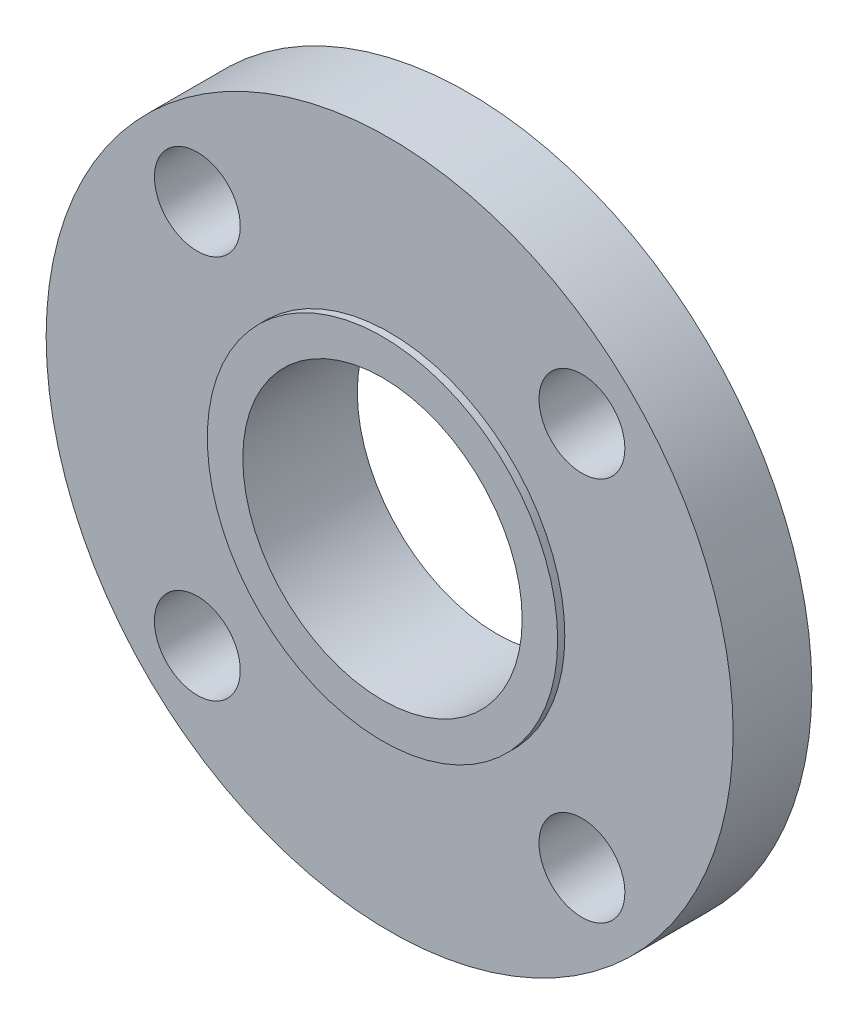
from build123d import *

# Parameters (mm, degrees)
HUB_DIAMETER_R                = 38.862
HUB_DEPTH                     = 25.4
FLANGE_DIAMETER_R             = 76.2
FLANGE_DEPTH                  = 17.4625
REVOLUTION_PROFILE_FOR_BORE_W = 30.988
REVOLUTION_PROFILE_FOR_BORE_H = 228.6
BOLT_DIAMETER_R               = 9.525
BOLT_HOLE_DEPTH               = 111.362652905
BOLT_HOLE_PATTERN_COUNT       = 4
BOLT_HOLE_PATTERN_ANGLE       = 270


with BuildPart() as part:
    # Hub Diameter → Hub (new body)
    with BuildSketch(Plane.XY):
        Circle(HUB_DIAMETER_R)
    extrude(amount=-HUB_DEPTH)

    # Flange Diameter → Flange (add)
    with BuildSketch(Plane.XY.offset(-1.5875)):
        Circle(FLANGE_DIAMETER_R)
    extrude(amount=-FLANGE_DEPTH)

    # Revolution profile for Bore → Bore (revolve, cut)
    with BuildSketch(Plane(origin=(0, 0, 0), x_dir=(1, 0, 0), z_dir=(0, 1, 0))):
        with Locations((15.494, 114.3)):
            Rectangle(REVOLUTION_PROFILE_FOR_BORE_W, REVOLUTION_PROFILE_FOR_BORE_H)
    revolve(axis=Axis((0, 0, 19.52131148), (0, 0, -1)), mode=Mode.SUBTRACT)

    # Bolt Diameter → Bolt Hole (cut, through all)
    with BuildSketch(Plane.XY.offset(-1.5875)):
        with Locations((42.656216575, 42.656216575)):
            Circle(BOLT_DIAMETER_R)
    bolt_hole = extrude(amount=-BOLT_HOLE_DEPTH, mode=Mode.SUBTRACT)

    # Bolt Hole Pattern: Bolt Hole ×4 about axis
    bolt_hole_pattern_axis = Axis((0, 0, -50), (0, 0, 1))
    for i in range(1, BOLT_HOLE_PATTERN_COUNT):
        add(bolt_hole.rotate(bolt_hole_pattern_axis, i * BOLT_HOLE_PATTERN_ANGLE / (BOLT_HOLE_PATTERN_COUNT - 1)), mode=Mode.SUBTRACT)


solid = part.part
